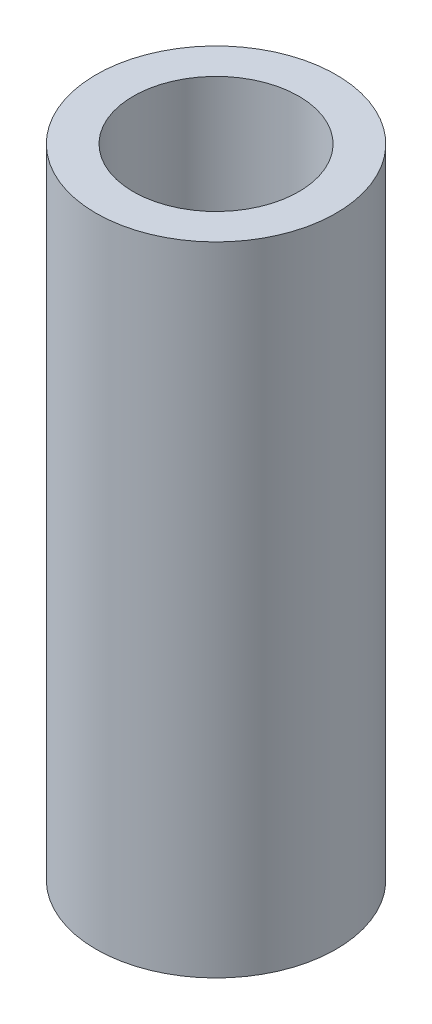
from build123d import *

# Parameters (mm, degrees)
SKIZZE1_R                       = 7.25
SKIZZE1_R_2                     = 5
AUFSATZ_LINEAR_AUSTRAGEN1_DEPTH = 19.25


with BuildPart() as part:
    # Skizze1 → Aufsatz-Linear austragen1 (new, symmetric)
    with BuildSketch(Plane(origin=(0, 0, 0), x_dir=(1, 0, 0), z_dir=(0, 1, 0))):
        with Locations(Location((0, 0, 0), (0, 0, 270))):
            Circle(SKIZZE1_R)
        with Locations(Location((0, 0, 0), (0, 0, 270))):
            Circle(SKIZZE1_R_2, mode=Mode.SUBTRACT)
    extrude(amount=AUFSATZ_LINEAR_AUSTRAGEN1_DEPTH, both=True)


solid = part.part
